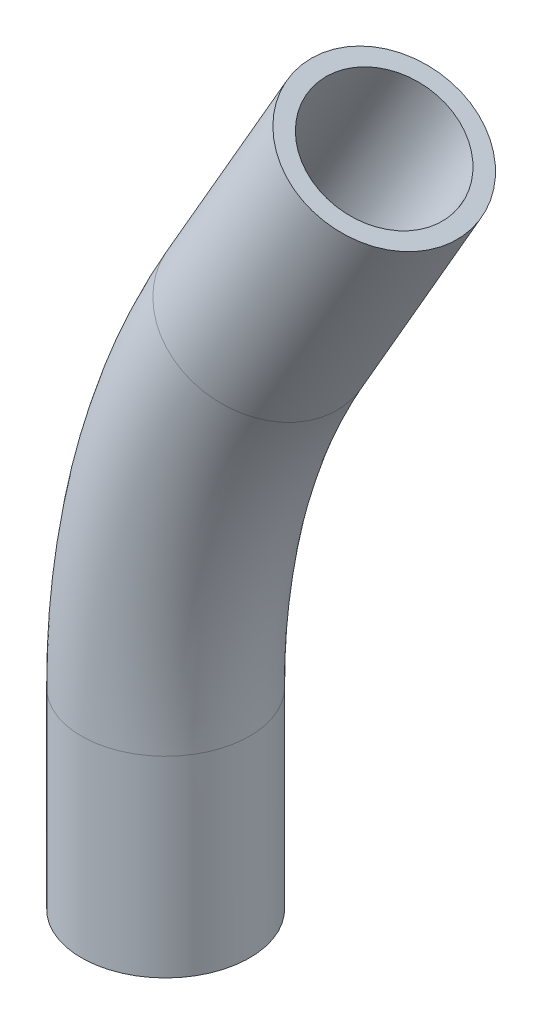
from build123d import *

# Parameters (mm, degrees)
ROUTE_R                       = 16.7005
ELBOWSHELL_T                  = -3.3782
SKETCH2_R                     = 16.7005
SKETCH2_R_2                   = 13.3223
ELBOWEXTENSION_EXTRUDE1_DEPTH = 47.625
SKETCH3_R                     = 16.7005
SKETCH3_R_2                   = 13.3223
ELBOWEXTENSION_EXTRUDE2_DEPTH = 38.1


with BuildPart() as part:
    # Elbow: sweep along a path in ElbowArc
    with BuildLine(Plane.XY) as elbow_path:
        ThreePointArc((-146.05, 0), (-141.07346693, 37.800521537), (-126.483010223, 73.025))
    # Route → Elbow (sweep)
    with BuildSketch(Plane(origin=(0, 0, 0), x_dir=(1, 0, 0), z_dir=(0, 1, 0))):
        with Locations((-146.05, 0)):
            Circle(ROUTE_R)
    sweep(path=elbow_path.line)

    # ElbowShell
    elbowshell_openings = [part.faces().sort_by_distance(p)[0] for p in [
        (-126.483010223, 73.025, 0),
        (-146.05, 0, 0),
    ]]
    offset(amount=ELBOWSHELL_T, openings=elbowshell_openings, kind=Kind.INTERSECTION)

    # Sketch2 → ElbowExtension-Extrude1 (add)
    with BuildSketch(Plane(origin=(0, 0, 0), x_dir=(-0.8660254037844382, 0.500000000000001, 0), z_dir=(0.5000000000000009, 0.866025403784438, 0))):
        with Locations((146.05, 0)):
            Circle(SKETCH2_R)
        with Locations((146.05, 0)):
            Circle(SKETCH2_R_2, mode=Mode.SUBTRACT)
    extrude(amount=ELBOWEXTENSION_EXTRUDE1_DEPTH)

    # Sketch3 → ElbowExtension-Extrude2 (add)
    with BuildSketch(Plane.XZ):
        with Locations(Location((-146.05, 0, 0), (0, 0, 180))):
            Circle(SKETCH3_R)
        with Locations(Location((-146.05, 0, 0), (0, 0, 180))):
            Circle(SKETCH3_R_2, mode=Mode.SUBTRACT)
    extrude(amount=ELBOWEXTENSION_EXTRUDE2_DEPTH)


solid = part.part
